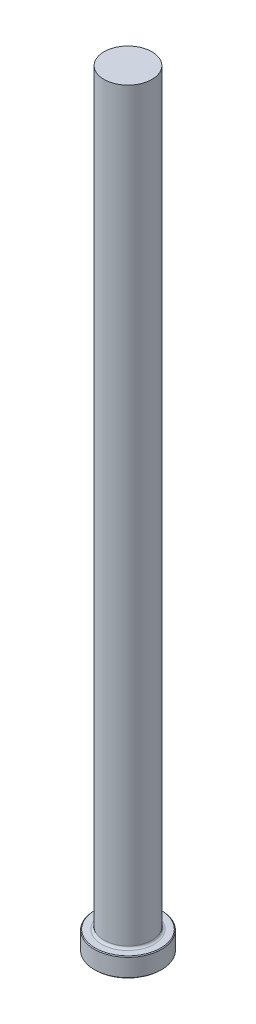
ISO-10303-21;
HEADER;
FILE_DESCRIPTION(('STEP AP214'),'2;1');
FILE_NAME('part.step','',(''),(''),'','','');
FILE_SCHEMA(('AUTOMOTIVE_DESIGN { 1 0 10303 214 1 1 1 1 }'));
ENDSEC;
DATA;
#1=APPLICATION_CONTEXT('core data for automotive mechanical design processes');
#2=APPLICATION_PROTOCOL_DEFINITION('international standard','automotive_design',2000,#1);
#3=PRODUCT_CONTEXT('',#1,'mechanical');
#4=PRODUCT('Part','Part','',(#3));
#5=PRODUCT_RELATED_PRODUCT_CATEGORY('part','',(#4));
#6=PRODUCT_DEFINITION_FORMATION('','',#4);
#7=PRODUCT_DEFINITION_CONTEXT('part definition',#1,'design');
#8=PRODUCT_DEFINITION('design','',#6,#7);
#9=PRODUCT_DEFINITION_SHAPE('','',#8);
#10=(LENGTH_UNIT() NAMED_UNIT(*) SI_UNIT(.MILLI.,.METRE.));
#11=(NAMED_UNIT(*) PLANE_ANGLE_UNIT() SI_UNIT($,.RADIAN.));
#12=(NAMED_UNIT(*) SI_UNIT($,.STERADIAN.) SOLID_ANGLE_UNIT());
#13=UNCERTAINTY_MEASURE_WITH_UNIT(LENGTH_MEASURE(1.E-05),#10,'distance_accuracy_value','');
#14=(GEOMETRIC_REPRESENTATION_CONTEXT(3) GLOBAL_UNCERTAINTY_ASSIGNED_CONTEXT((#13)) GLOBAL_UNIT_ASSIGNED_CONTEXT((#10,
#11,#12)) REPRESENTATION_CONTEXT('',''));
#15=CARTESIAN_POINT('',(0.,0.,0.));
#16=DIRECTION('',(0.,0.,1.));
#17=DIRECTION('',(1.,0.,0.));
#18=AXIS2_PLACEMENT_3D('',#15,#16,#17);
#19=CARTESIAN_POINT('',(0.,0.,0.));
#20=DIRECTION('',(0.,-1.,0.));
#21=DIRECTION('',(0.,0.,-1.));
#22=AXIS2_PLACEMENT_3D('',#19,#20,#21);
#23=PLANE('',#22);
#24=CARTESIAN_POINT('',(0.,0.,0.));
#25=DIRECTION('',(0.,-1.,0.));
#26=DIRECTION('',(0.,0.,-1.));
#27=AXIS2_PLACEMENT_3D('',#24,#25,#26);
#28=CIRCLE('',#27,10.8584999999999);
#29=CARTESIAN_POINT('',(0.,0.,-10.8584999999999));
#30=VERTEX_POINT('',#29);
#31=EDGE_CURVE('E46',#30,#30,#28,.T.);
#32=ORIENTED_EDGE('',*,*,#31,.T.);
#33=EDGE_LOOP('',(#32));
#34=FACE_BOUND('',#33,.T.);
#35=ADVANCED_FACE('F35',(#34),#23,.T.);
#36=CARTESIAN_POINT('',(0.,259.958771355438,0.));
#37=DIRECTION('',(0.,1.,0.));
#38=DIRECTION('',(0.,0.,1.));
#39=AXIS2_PLACEMENT_3D('',#36,#37,#38);
#40=CYLINDRICAL_SURFACE('',#39,11.1125);
#41=CARTESIAN_POINT('',(0.,6.09599999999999,0.));
#42=DIRECTION('',(0.,1.,0.));
#43=DIRECTION('',(0.,0.,1.));
#44=AXIS2_PLACEMENT_3D('',#41,#42,#43);
#45=CIRCLE('',#44,11.1125);
#46=CARTESIAN_POINT('',(0.,6.09599999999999,11.1125));
#47=VERTEX_POINT('',#46);
#48=EDGE_CURVE('E50',#47,#47,#45,.F.);
#49=ORIENTED_EDGE('',*,*,#48,.T.);
#50=EDGE_LOOP('',(#49));
#51=FACE_BOUND('',#50,.T.);
#52=CARTESIAN_POINT('',(0.,0.254000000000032,0.));
#53=DIRECTION('',(0.,-1.,0.));
#54=DIRECTION('',(0.,0.,-1.));
#55=AXIS2_PLACEMENT_3D('',#52,#53,#54);
#56=CIRCLE('',#55,11.1125);
#57=CARTESIAN_POINT('',(0.,0.254000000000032,-11.1125));
#58=VERTEX_POINT('',#57);
#59=EDGE_CURVE('E55',#58,#58,#56,.F.);
#60=ORIENTED_EDGE('',*,*,#59,.T.);
#61=EDGE_LOOP('',(#60));
#62=FACE_BOUND('',#61,.T.);
#63=ADVANCED_FACE('F77',(#51,#62),#40,.T.);
#64=CARTESIAN_POINT('',(-11.1125,6.35,0.));
#65=DIRECTION('',(0.,1.,0.));
#66=DIRECTION('',(0.,0.,1.));
#67=AXIS2_PLACEMENT_3D('',#64,#65,#66);
#68=PLANE('',#67);
#69=CARTESIAN_POINT('',(0.,6.35,0.));
#70=DIRECTION('',(0.,1.,0.));
#71=DIRECTION('',(0.,0.,1.));
#72=AXIS2_PLACEMENT_3D('',#69,#70,#71);
#73=CIRCLE('',#72,8.69949999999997);
#74=CARTESIAN_POINT('',(0.,6.35,8.69949999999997));
#75=VERTEX_POINT('',#74);
#76=EDGE_CURVE('E10',#75,#75,#73,.F.);
#77=ORIENTED_EDGE('',*,*,#76,.T.);
#78=EDGE_LOOP('',(#77));
#79=FACE_BOUND('',#78,.T.);
#80=CARTESIAN_POINT('',(0.,6.35,0.));
#81=DIRECTION('',(0.,1.,0.));
#82=DIRECTION('',(0.,0.,1.));
#83=AXIS2_PLACEMENT_3D('',#80,#81,#82);
#84=CIRCLE('',#83,10.8585);
#85=CARTESIAN_POINT('',(0.,6.35,10.8585));
#86=VERTEX_POINT('',#85);
#87=EDGE_CURVE('E58',#86,#86,#84,.T.);
#88=ORIENTED_EDGE('',*,*,#87,.T.);
#89=EDGE_LOOP('',(#88));
#90=FACE_BOUND('',#89,.T.);
#91=ADVANCED_FACE('F69',(#79,#90),#68,.T.);
#92=CARTESIAN_POINT('',(0.,259.958771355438,0.));
#93=DIRECTION('',(0.,1.,0.));
#94=DIRECTION('',(0.,0.,1.));
#95=AXIS2_PLACEMENT_3D('',#92,#93,#94);
#96=CYLINDRICAL_SURFACE('',#95,7.93749999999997);
#97=CARTESIAN_POINT('',(0.,7.11200000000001,0.));
#98=DIRECTION('',(0.,1.,0.));
#99=DIRECTION('',(0.,0.,1.));
#100=AXIS2_PLACEMENT_3D('',#97,#98,#99);
#101=CIRCLE('',#100,7.93749999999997);
#102=CARTESIAN_POINT('',(0.,7.11200000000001,7.93749999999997));
#103=VERTEX_POINT('',#102);
#104=EDGE_CURVE('E42',#103,#103,#101,.T.);
#105=ORIENTED_EDGE('',*,*,#104,.T.);
#106=EDGE_LOOP('',(#105));
#107=FACE_BOUND('',#106,.T.);
#108=CARTESIAN_POINT('',(0.,254.,0.));
#109=DIRECTION('',(0.,1.,0.));
#110=DIRECTION('',(0.,0.,1.));
#111=AXIS2_PLACEMENT_3D('',#108,#109,#110);
#112=CIRCLE('',#111,7.93749999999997);
#113=CARTESIAN_POINT('',(0.,254.,7.93749999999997));
#114=VERTEX_POINT('',#113);
#115=EDGE_CURVE('E61',#114,#114,#112,.T.);
#116=ORIENTED_EDGE('',*,*,#115,.F.);
#117=EDGE_LOOP('',(#116));
#118=FACE_BOUND('',#117,.T.);
#119=ADVANCED_FACE('F67',(#107,#118),#96,.T.);
#120=CARTESIAN_POINT('',(-7.93749999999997,254.,0.));
#121=DIRECTION('',(0.,1.,0.));
#122=DIRECTION('',(0.,0.,1.));
#123=AXIS2_PLACEMENT_3D('',#120,#121,#122);
#124=PLANE('',#123);
#125=ORIENTED_EDGE('',*,*,#115,.T.);
#126=EDGE_LOOP('',(#125));
#127=FACE_BOUND('',#126,.T.);
#128=ADVANCED_FACE('F65',(#127),#124,.T.);
#129=CARTESIAN_POINT('',(0.,6.35000000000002,0.));
#130=DIRECTION('',(0.,-1.,0.));
#131=DIRECTION('',(0.,0.,-1.));
#132=AXIS2_PLACEMENT_3D('',#129,#130,#131);
#133=CONICAL_SURFACE('',#132,10.8585,0.78539816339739);
#134=ORIENTED_EDGE('',*,*,#48,.F.);
#135=EDGE_LOOP('',(#134));
#136=FACE_BOUND('',#135,.T.);
#137=ORIENTED_EDGE('',*,*,#87,.F.);
#138=EDGE_LOOP('',(#137));
#139=FACE_BOUND('',#138,.T.);
#140=ADVANCED_FACE('F75',(#136,#139),#133,.T.);
#141=CARTESIAN_POINT('',(0.,0.254000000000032,0.));
#142=DIRECTION('',(0.,1.,0.));
#143=DIRECTION('',(0.,0.,1.));
#144=AXIS2_PLACEMENT_3D('',#141,#142,#143);
#145=CONICAL_SURFACE('',#144,11.1125,0.785398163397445);
#146=ORIENTED_EDGE('',*,*,#31,.F.);
#147=EDGE_LOOP('',(#146));
#148=FACE_BOUND('',#147,.T.);
#149=ORIENTED_EDGE('',*,*,#59,.F.);
#150=EDGE_LOOP('',(#149));
#151=FACE_BOUND('',#150,.T.);
#152=ADVANCED_FACE('F89',(#148,#151),#145,.T.);
#153=CARTESIAN_POINT('',(0.,7.11200000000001,0.));
#154=DIRECTION('',(0.,1.,0.));
#155=DIRECTION('',(0.,0.,1.));
#156=AXIS2_PLACEMENT_3D('',#153,#154,#155);
#157=TOROIDAL_SURFACE('',#156,8.69949999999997,0.762);
#158=ORIENTED_EDGE('',*,*,#76,.F.);
#159=EDGE_LOOP('',(#158));
#160=FACE_BOUND('',#159,.T.);
#161=ORIENTED_EDGE('',*,*,#104,.F.);
#162=EDGE_LOOP('',(#161));
#163=FACE_BOUND('',#162,.T.);
#164=ADVANCED_FACE('F37',(#160,#163),#157,.F.);
#165=CLOSED_SHELL('',(#35,#63,#91,#119,#128,#140,#152,#164));
#166=MANIFOLD_SOLID_BREP('B2',#165);
#167=ADVANCED_BREP_SHAPE_REPRESENTATION('',(#18,#166),#14);
#168=SHAPE_DEFINITION_REPRESENTATION(#9,#167);
ENDSEC;
END-ISO-10303-21;
